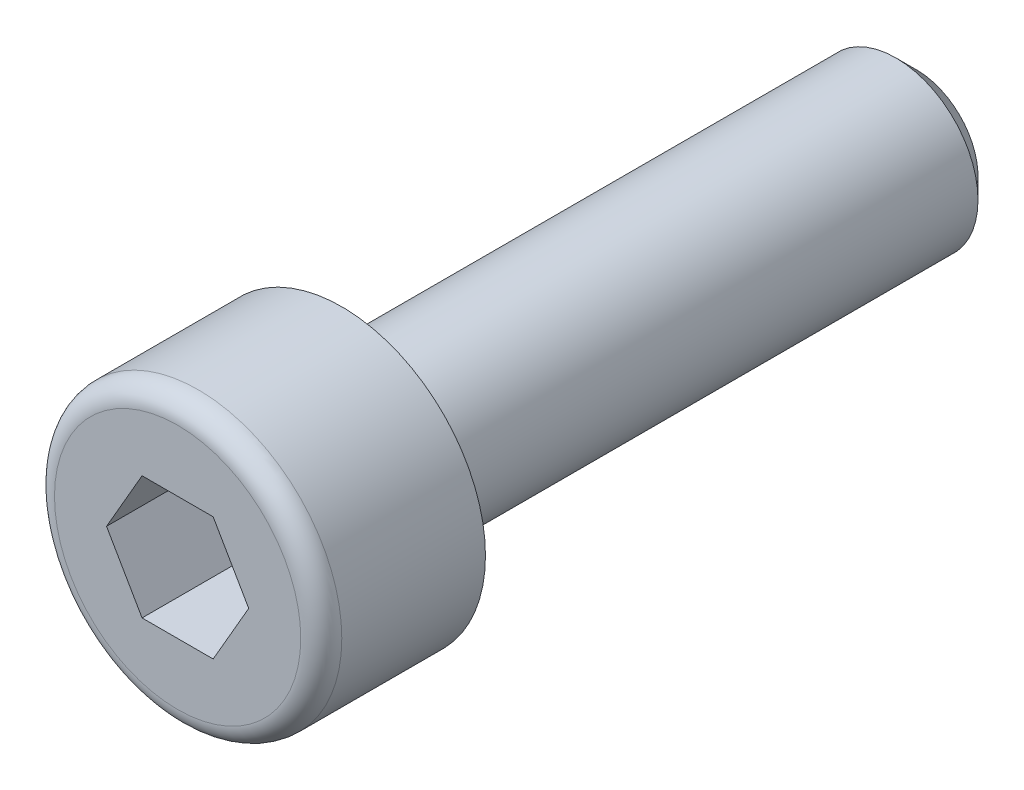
ISO-10303-21;
HEADER;
FILE_DESCRIPTION(('STEP AP214'),'2;1');
FILE_NAME('part.step','',(''),(''),'','','');
FILE_SCHEMA(('AUTOMOTIVE_DESIGN { 1 0 10303 214 1 1 1 1 }'));
ENDSEC;
DATA;
#1=APPLICATION_CONTEXT('core data for automotive mechanical design processes');
#2=APPLICATION_PROTOCOL_DEFINITION('international standard','automotive_design',2000,#1);
#3=PRODUCT_CONTEXT('',#1,'mechanical');
#4=PRODUCT('Part','Part','',(#3));
#5=PRODUCT_RELATED_PRODUCT_CATEGORY('part','',(#4));
#6=PRODUCT_DEFINITION_FORMATION('','',#4);
#7=PRODUCT_DEFINITION_CONTEXT('part definition',#1,'design');
#8=PRODUCT_DEFINITION('design','',#6,#7);
#9=PRODUCT_DEFINITION_SHAPE('','',#8);
#10=(LENGTH_UNIT() NAMED_UNIT(*) SI_UNIT(.MILLI.,.METRE.));
#11=(NAMED_UNIT(*) PLANE_ANGLE_UNIT() SI_UNIT($,.RADIAN.));
#12=(NAMED_UNIT(*) SI_UNIT($,.STERADIAN.) SOLID_ANGLE_UNIT());
#13=UNCERTAINTY_MEASURE_WITH_UNIT(LENGTH_MEASURE(1.E-05),#10,'distance_accuracy_value','');
#14=(GEOMETRIC_REPRESENTATION_CONTEXT(3) GLOBAL_UNCERTAINTY_ASSIGNED_CONTEXT((#13)) GLOBAL_UNIT_ASSIGNED_CONTEXT((#10,
#11,#12)) REPRESENTATION_CONTEXT('',''));
#15=CARTESIAN_POINT('',(0.,0.,0.));
#16=DIRECTION('',(0.,0.,1.));
#17=DIRECTION('',(1.,0.,0.));
#18=AXIS2_PLACEMENT_3D('',#15,#16,#17);
#19=CARTESIAN_POINT('',(0.,0.,0.));
#20=DIRECTION('',(0.,0.,1.));
#21=DIRECTION('',(1.,0.,0.));
#22=AXIS2_PLACEMENT_3D('',#19,#20,#21);
#23=PLANE('',#22);
#24=CARTESIAN_POINT('',(0.,0.,0.));
#25=DIRECTION('',(0.,0.,1.));
#26=DIRECTION('',(1.,0.,0.));
#27=AXIS2_PLACEMENT_3D('',#24,#25,#26);
#28=CIRCLE('',#27,3.5);
#29=CARTESIAN_POINT('',(3.5,0.,0.));
#30=VERTEX_POINT('',#29);
#31=EDGE_CURVE('E137',#30,#30,#28,.T.);
#32=ORIENTED_EDGE('',*,*,#31,.F.);
#33=EDGE_LOOP('',(#32));
#34=FACE_BOUND('',#33,.T.);
#35=CARTESIAN_POINT('',(0.,0.,0.));
#36=DIRECTION('',(0.,0.,1.));
#37=DIRECTION('',(1.,0.,0.));
#38=AXIS2_PLACEMENT_3D('',#35,#36,#37);
#39=CIRCLE('',#38,2.);
#40=CARTESIAN_POINT('',(2.,0.,0.));
#41=VERTEX_POINT('',#40);
#42=EDGE_CURVE('E146',#41,#41,#39,.F.);
#43=ORIENTED_EDGE('',*,*,#42,.F.);
#44=EDGE_LOOP('',(#43));
#45=FACE_BOUND('',#44,.T.);
#46=ADVANCED_FACE('F35',(#34,#45),#23,.F.);
#47=CARTESIAN_POINT('',(0.,0.,4.));
#48=DIRECTION('',(0.,0.,-1.));
#49=DIRECTION('',(-1.,0.,0.));
#50=AXIS2_PLACEMENT_3D('',#47,#48,#49);
#51=CYLINDRICAL_SURFACE('',#50,3.5);
#52=CARTESIAN_POINT('',(0.,0.,3.5));
#53=DIRECTION('',(0.,0.,1.));
#54=DIRECTION('',(1.,0.,0.));
#55=AXIS2_PLACEMENT_3D('',#52,#53,#54);
#56=CIRCLE('',#55,3.5);
#57=CARTESIAN_POINT('',(3.5,0.,3.5));
#58=VERTEX_POINT('',#57);
#59=EDGE_CURVE('E152',#58,#58,#56,.F.);
#60=ORIENTED_EDGE('',*,*,#59,.T.);
#61=EDGE_LOOP('',(#60));
#62=FACE_BOUND('',#61,.T.);
#63=ORIENTED_EDGE('',*,*,#31,.T.);
#64=EDGE_LOOP('',(#63));
#65=FACE_BOUND('',#64,.T.);
#66=ADVANCED_FACE('F37',(#62,#65),#51,.T.);
#67=CARTESIAN_POINT('',(0.,0.,4.));
#68=DIRECTION('',(0.,0.,1.));
#69=DIRECTION('',(1.,0.,0.));
#70=AXIS2_PLACEMENT_3D('',#67,#68,#69);
#71=PLANE('',#70);
#72=CARTESIAN_POINT('',(0.,0.,4.));
#73=DIRECTION('',(0.,0.,1.));
#74=DIRECTION('',(1.,0.,0.));
#75=AXIS2_PLACEMENT_3D('',#72,#73,#74);
#76=CIRCLE('',#75,3.);
#77=CARTESIAN_POINT('',(3.,0.,4.));
#78=VERTEX_POINT('',#77);
#79=EDGE_CURVE('E149',#78,#78,#76,.T.);
#80=ORIENTED_EDGE('',*,*,#79,.T.);
#81=EDGE_LOOP('',(#80));
#82=FACE_BOUND('',#81,.T.);
#83=DIRECTION('',(0.500000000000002,0.866025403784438,0.));
#84=VECTOR('',#83,1.);
#85=CARTESIAN_POINT('',(0.866025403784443,-1.5,4.));
#86=LINE('',#85,#84);
#87=CARTESIAN_POINT('',(0.866025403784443,-1.5,4.));
#88=VERTEX_POINT('',#87);
#89=CARTESIAN_POINT('',(1.73205080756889,0.,4.));
#90=VERTEX_POINT('',#89);
#91=EDGE_CURVE('E50',#88,#90,#86,.T.);
#92=ORIENTED_EDGE('',*,*,#91,.F.);
#93=DIRECTION('',(1.,0.,0.));
#94=VECTOR('',#93,1.);
#95=CARTESIAN_POINT('',(-0.866025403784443,-1.5,4.));
#96=LINE('',#95,#94);
#97=CARTESIAN_POINT('',(-0.866025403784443,-1.5,4.));
#98=VERTEX_POINT('',#97);
#99=EDGE_CURVE('E119',#98,#88,#96,.T.);
#100=ORIENTED_EDGE('',*,*,#99,.F.);
#101=DIRECTION('',(0.500000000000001,-0.866025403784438,0.));
#102=VECTOR('',#101,1.);
#103=CARTESIAN_POINT('',(-1.73205080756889,0.,4.));
#104=LINE('',#103,#102);
#105=CARTESIAN_POINT('',(-1.73205080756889,0.,4.));
#106=VERTEX_POINT('',#105);
#107=EDGE_CURVE('E113',#106,#98,#104,.T.);
#108=ORIENTED_EDGE('',*,*,#107,.F.);
#109=DIRECTION('',(-0.500000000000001,-0.866025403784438,0.));
#110=VECTOR('',#109,1.);
#111=CARTESIAN_POINT('',(-0.866025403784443,1.5,4.));
#112=LINE('',#111,#110);
#113=CARTESIAN_POINT('',(-0.866025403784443,1.5,4.));
#114=VERTEX_POINT('',#113);
#115=EDGE_CURVE('E111',#114,#106,#112,.T.);
#116=ORIENTED_EDGE('',*,*,#115,.F.);
#117=DIRECTION('',(-1.,0.,0.));
#118=VECTOR('',#117,1.);
#119=CARTESIAN_POINT('',(0.866025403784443,1.5,4.));
#120=LINE('',#119,#118);
#121=CARTESIAN_POINT('',(0.866025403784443,1.5,4.));
#122=VERTEX_POINT('',#121);
#123=EDGE_CURVE('E93',#122,#114,#120,.T.);
#124=ORIENTED_EDGE('',*,*,#123,.F.);
#125=DIRECTION('',(-0.500000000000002,0.866025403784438,0.));
#126=VECTOR('',#125,1.);
#127=CARTESIAN_POINT('',(1.73205080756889,0.,4.));
#128=LINE('',#127,#126);
#129=EDGE_CURVE('E104',#90,#122,#128,.T.);
#130=ORIENTED_EDGE('',*,*,#129,.F.);
#131=EDGE_LOOP('',(#92,#100,#108,#116,#124,#130));
#132=FACE_BOUND('',#131,.T.);
#133=ADVANCED_FACE('F108',(#82,#132),#71,.T.);
#134=CARTESIAN_POINT('',(0.,0.,-14.));
#135=DIRECTION('',(0.,0.,1.));
#136=DIRECTION('',(1.,0.,0.));
#137=AXIS2_PLACEMENT_3D('',#134,#135,#136);
#138=CYLINDRICAL_SURFACE('',#137,2.);
#139=CARTESIAN_POINT('',(0.,0.,-13.5));
#140=DIRECTION('',(0.,0.,-1.));
#141=DIRECTION('',(-1.,0.,0.));
#142=AXIS2_PLACEMENT_3D('',#139,#140,#141);
#143=CIRCLE('',#142,2.);
#144=CARTESIAN_POINT('',(-2.,0.,-13.5));
#145=VERTEX_POINT('',#144);
#146=EDGE_CURVE('E11',#145,#145,#143,.F.);
#147=ORIENTED_EDGE('',*,*,#146,.T.);
#148=EDGE_LOOP('',(#147));
#149=FACE_BOUND('',#148,.T.);
#150=ORIENTED_EDGE('',*,*,#42,.T.);
#151=EDGE_LOOP('',(#150));
#152=FACE_BOUND('',#151,.T.);
#153=ADVANCED_FACE('F181',(#149,#152),#138,.T.);
#154=CARTESIAN_POINT('',(0.,0.,-14.));
#155=DIRECTION('',(0.,0.,-1.));
#156=DIRECTION('',(-1.,0.,0.));
#157=AXIS2_PLACEMENT_3D('',#154,#155,#156);
#158=PLANE('',#157);
#159=CARTESIAN_POINT('',(0.,0.,-14.));
#160=DIRECTION('',(0.,0.,-1.));
#161=DIRECTION('',(-1.,0.,0.));
#162=AXIS2_PLACEMENT_3D('',#159,#160,#161);
#163=CIRCLE('',#162,1.49999999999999);
#164=CARTESIAN_POINT('',(-1.49999999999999,0.,-14.));
#165=VERTEX_POINT('',#164);
#166=EDGE_CURVE('E43',#165,#165,#163,.T.);
#167=ORIENTED_EDGE('',*,*,#166,.T.);
#168=EDGE_LOOP('',(#167));
#169=FACE_BOUND('',#168,.T.);
#170=ADVANCED_FACE('F157',(#169),#158,.T.);
#171=CARTESIAN_POINT('',(0.866025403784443,-1.5,1.));
#172=DIRECTION('',(0.866025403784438,-0.500000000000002,0.));
#173=DIRECTION('',(0.500000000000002,0.866025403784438,0.));
#174=AXIS2_PLACEMENT_3D('',#171,#172,#173);
#175=PLANE('',#174);
#176=ORIENTED_EDGE('',*,*,#91,.T.);
#177=DIRECTION('',(0.,0.,1.));
#178=VECTOR('',#177,1.);
#179=CARTESIAN_POINT('',(1.73205080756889,0.,1.));
#180=LINE('',#179,#178);
#181=CARTESIAN_POINT('',(1.73205080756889,0.,1.));
#182=VERTEX_POINT('',#181);
#183=EDGE_CURVE('E101',#182,#90,#180,.T.);
#184=ORIENTED_EDGE('',*,*,#183,.F.);
#185=DIRECTION('',(0.500000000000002,0.866025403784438,0.));
#186=VECTOR('',#185,1.);
#187=CARTESIAN_POINT('',(0.866025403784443,-1.5,1.));
#188=LINE('',#187,#186);
#189=CARTESIAN_POINT('',(0.866025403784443,-1.5,1.));
#190=VERTEX_POINT('',#189);
#191=EDGE_CURVE('E121',#190,#182,#188,.T.);
#192=ORIENTED_EDGE('',*,*,#191,.F.);
#193=DIRECTION('',(0.,0.,1.));
#194=VECTOR('',#193,1.);
#195=CARTESIAN_POINT('',(0.866025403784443,-1.5,1.));
#196=LINE('',#195,#194);
#197=EDGE_CURVE('E57',#190,#88,#196,.T.);
#198=ORIENTED_EDGE('',*,*,#197,.T.);
#199=EDGE_LOOP('',(#176,#184,#192,#198));
#200=FACE_BOUND('',#199,.T.);
#201=ADVANCED_FACE('F194',(#200),#175,.F.);
#202=CARTESIAN_POINT('',(-0.866025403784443,-1.5,1.));
#203=DIRECTION('',(0.,-1.,0.));
#204=DIRECTION('',(1.,0.,0.));
#205=AXIS2_PLACEMENT_3D('',#202,#203,#204);
#206=PLANE('',#205);
#207=ORIENTED_EDGE('',*,*,#99,.T.);
#208=ORIENTED_EDGE('',*,*,#197,.F.);
#209=DIRECTION('',(1.,0.,0.));
#210=VECTOR('',#209,1.);
#211=CARTESIAN_POINT('',(-0.866025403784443,-1.5,1.));
#212=LINE('',#211,#210);
#213=CARTESIAN_POINT('',(-0.866025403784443,-1.5,1.));
#214=VERTEX_POINT('',#213);
#215=EDGE_CURVE('E133',#214,#190,#212,.T.);
#216=ORIENTED_EDGE('',*,*,#215,.F.);
#217=DIRECTION('',(0.,0.,1.));
#218=VECTOR('',#217,1.);
#219=CARTESIAN_POINT('',(-0.866025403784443,-1.5,1.));
#220=LINE('',#219,#218);
#221=EDGE_CURVE('E138',#214,#98,#220,.T.);
#222=ORIENTED_EDGE('',*,*,#221,.T.);
#223=EDGE_LOOP('',(#207,#208,#216,#222));
#224=FACE_BOUND('',#223,.T.);
#225=ADVANCED_FACE('F200',(#224),#206,.F.);
#226=CARTESIAN_POINT('',(-1.73205080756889,0.,1.));
#227=DIRECTION('',(-0.866025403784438,-0.500000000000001,0.));
#228=DIRECTION('',(0.500000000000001,-0.866025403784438,0.));
#229=AXIS2_PLACEMENT_3D('',#226,#227,#228);
#230=PLANE('',#229);
#231=ORIENTED_EDGE('',*,*,#107,.T.);
#232=ORIENTED_EDGE('',*,*,#221,.F.);
#233=DIRECTION('',(0.500000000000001,-0.866025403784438,0.));
#234=VECTOR('',#233,1.);
#235=CARTESIAN_POINT('',(-1.73205080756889,0.,1.));
#236=LINE('',#235,#234);
#237=CARTESIAN_POINT('',(-1.73205080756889,0.,1.));
#238=VERTEX_POINT('',#237);
#239=EDGE_CURVE('E130',#238,#214,#236,.T.);
#240=ORIENTED_EDGE('',*,*,#239,.F.);
#241=DIRECTION('',(0.,0.,1.));
#242=VECTOR('',#241,1.);
#243=CARTESIAN_POINT('',(-1.73205080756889,0.,1.));
#244=LINE('',#243,#242);
#245=EDGE_CURVE('E140',#238,#106,#244,.T.);
#246=ORIENTED_EDGE('',*,*,#245,.T.);
#247=EDGE_LOOP('',(#231,#232,#240,#246));
#248=FACE_BOUND('',#247,.T.);
#249=ADVANCED_FACE('F210',(#248),#230,.F.);
#250=CARTESIAN_POINT('',(-0.866025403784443,1.5,1.));
#251=DIRECTION('',(-0.866025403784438,0.500000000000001,0.));
#252=DIRECTION('',(-0.500000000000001,-0.866025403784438,0.));
#253=AXIS2_PLACEMENT_3D('',#250,#251,#252);
#254=PLANE('',#253);
#255=ORIENTED_EDGE('',*,*,#115,.T.);
#256=ORIENTED_EDGE('',*,*,#245,.F.);
#257=DIRECTION('',(-0.500000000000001,-0.866025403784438,0.));
#258=VECTOR('',#257,1.);
#259=CARTESIAN_POINT('',(-0.866025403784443,1.5,1.));
#260=LINE('',#259,#258);
#261=CARTESIAN_POINT('',(-0.866025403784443,1.5,1.));
#262=VERTEX_POINT('',#261);
#263=EDGE_CURVE('E127',#262,#238,#260,.T.);
#264=ORIENTED_EDGE('',*,*,#263,.F.);
#265=DIRECTION('',(0.,0.,1.));
#266=VECTOR('',#265,1.);
#267=CARTESIAN_POINT('',(-0.866025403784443,1.5,1.));
#268=LINE('',#267,#266);
#269=EDGE_CURVE('E100',#262,#114,#268,.T.);
#270=ORIENTED_EDGE('',*,*,#269,.T.);
#271=EDGE_LOOP('',(#255,#256,#264,#270));
#272=FACE_BOUND('',#271,.T.);
#273=ADVANCED_FACE('F207',(#272),#254,.F.);
#274=CARTESIAN_POINT('',(0.866025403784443,1.5,1.));
#275=DIRECTION('',(0.,1.,0.));
#276=DIRECTION('',(0.,0.,1.));
#277=AXIS2_PLACEMENT_3D('',#274,#275,#276);
#278=PLANE('',#277);
#279=ORIENTED_EDGE('',*,*,#123,.T.);
#280=ORIENTED_EDGE('',*,*,#269,.F.);
#281=DIRECTION('',(-1.,0.,0.));
#282=VECTOR('',#281,1.);
#283=CARTESIAN_POINT('',(0.866025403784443,1.5,1.));
#284=LINE('',#283,#282);
#285=CARTESIAN_POINT('',(0.866025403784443,1.5,1.));
#286=VERTEX_POINT('',#285);
#287=EDGE_CURVE('E96',#286,#262,#284,.T.);
#288=ORIENTED_EDGE('',*,*,#287,.F.);
#289=DIRECTION('',(0.,0.,1.));
#290=VECTOR('',#289,1.);
#291=CARTESIAN_POINT('',(0.866025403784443,1.5,1.));
#292=LINE('',#291,#290);
#293=EDGE_CURVE('E89',#286,#122,#292,.T.);
#294=ORIENTED_EDGE('',*,*,#293,.T.);
#295=EDGE_LOOP('',(#279,#280,#288,#294));
#296=FACE_BOUND('',#295,.T.);
#297=ADVANCED_FACE('F91',(#296),#278,.F.);
#298=CARTESIAN_POINT('',(1.73205080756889,0.,1.));
#299=DIRECTION('',(0.866025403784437,0.500000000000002,0.));
#300=DIRECTION('',(-0.500000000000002,0.866025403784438,0.));
#301=AXIS2_PLACEMENT_3D('',#298,#299,#300);
#302=PLANE('',#301);
#303=ORIENTED_EDGE('',*,*,#129,.T.);
#304=ORIENTED_EDGE('',*,*,#293,.F.);
#305=DIRECTION('',(-0.500000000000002,0.866025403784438,0.));
#306=VECTOR('',#305,1.);
#307=CARTESIAN_POINT('',(1.73205080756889,0.,1.));
#308=LINE('',#307,#306);
#309=EDGE_CURVE('E124',#182,#286,#308,.T.);
#310=ORIENTED_EDGE('',*,*,#309,.F.);
#311=ORIENTED_EDGE('',*,*,#183,.T.);
#312=EDGE_LOOP('',(#303,#304,#310,#311));
#313=FACE_BOUND('',#312,.T.);
#314=ADVANCED_FACE('F105',(#313),#302,.F.);
#315=CARTESIAN_POINT('',(1.73205080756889,0.,1.));
#316=DIRECTION('',(0.,0.,1.));
#317=DIRECTION('',(1.,0.,0.));
#318=AXIS2_PLACEMENT_3D('',#315,#316,#317);
#319=PLANE('',#318);
#320=ORIENTED_EDGE('',*,*,#191,.T.);
#321=ORIENTED_EDGE('',*,*,#309,.T.);
#322=ORIENTED_EDGE('',*,*,#287,.T.);
#323=ORIENTED_EDGE('',*,*,#263,.T.);
#324=ORIENTED_EDGE('',*,*,#239,.T.);
#325=ORIENTED_EDGE('',*,*,#215,.T.);
#326=EDGE_LOOP('',(#320,#321,#322,#323,#324,#325));
#327=FACE_BOUND('',#326,.T.);
#328=ADVANCED_FACE('F167',(#327),#319,.T.);
#329=CARTESIAN_POINT('',(0.,0.,3.5));
#330=DIRECTION('',(0.,0.,1.));
#331=DIRECTION('',(1.,0.,0.));
#332=AXIS2_PLACEMENT_3D('',#329,#330,#331);
#333=TOROIDAL_SURFACE('',#332,3.,0.5);
#334=ORIENTED_EDGE('',*,*,#59,.F.);
#335=EDGE_LOOP('',(#334));
#336=FACE_BOUND('',#335,.T.);
#337=ORIENTED_EDGE('',*,*,#79,.F.);
#338=EDGE_LOOP('',(#337));
#339=FACE_BOUND('',#338,.T.);
#340=ADVANCED_FACE('F161',(#336,#339),#333,.T.);
#341=CARTESIAN_POINT('',(0.,0.,-14.));
#342=DIRECTION('',(0.,0.,1.));
#343=DIRECTION('',(1.,0.,0.));
#344=AXIS2_PLACEMENT_3D('',#341,#342,#343);
#345=CONICAL_SURFACE('',#344,1.49999999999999,0.785398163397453);
#346=ORIENTED_EDGE('',*,*,#146,.F.);
#347=EDGE_LOOP('',(#346));
#348=FACE_BOUND('',#347,.T.);
#349=ORIENTED_EDGE('',*,*,#166,.F.);
#350=EDGE_LOOP('',(#349));
#351=FACE_BOUND('',#350,.T.);
#352=ADVANCED_FACE('F159',(#348,#351),#345,.T.);
#353=CLOSED_SHELL('',(#46,#66,#133,#153,#170,#201,#225,#249,#273,#297,#314,#328,#340,#352));
#354=MANIFOLD_SOLID_BREP('B2',#353);
#355=ADVANCED_BREP_SHAPE_REPRESENTATION('',(#18,#354),#14);
#356=SHAPE_DEFINITION_REPRESENTATION(#9,#355);
ENDSEC;
END-ISO-10303-21;
